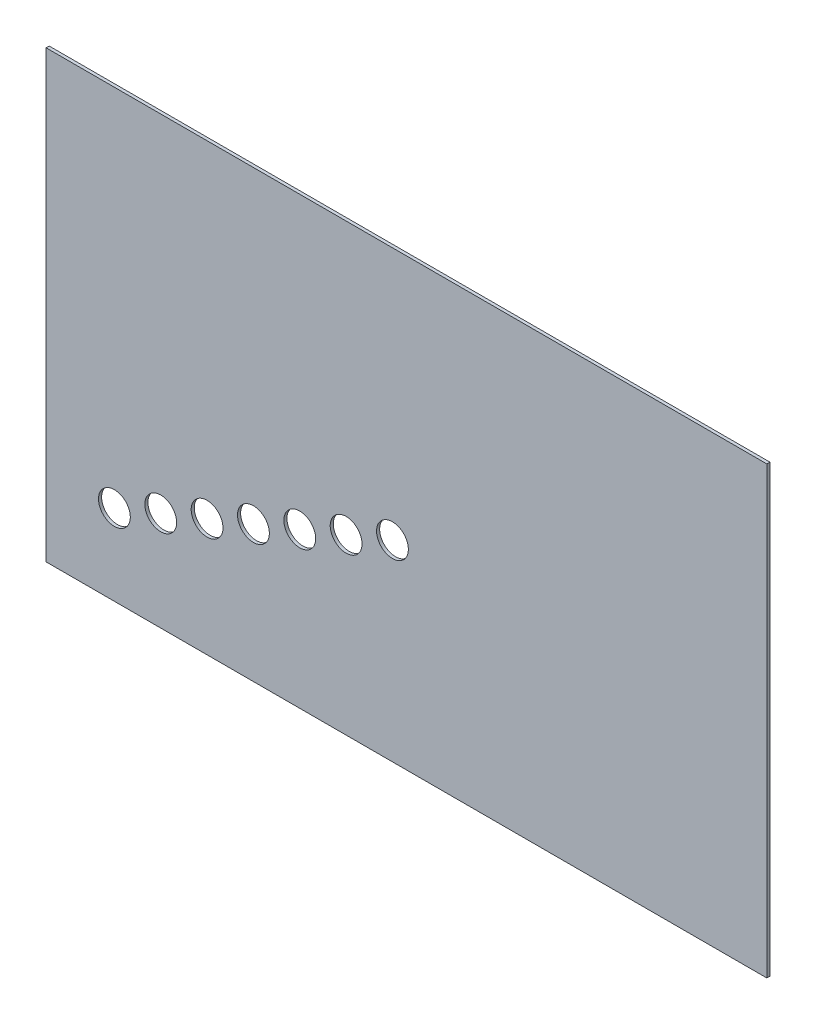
ISO-10303-21;
HEADER;
FILE_DESCRIPTION(('STEP AP214'),'2;1');
FILE_NAME('part.step','',(''),(''),'','','');
FILE_SCHEMA(('AUTOMOTIVE_DESIGN { 1 0 10303 214 1 1 1 1 }'));
ENDSEC;
DATA;
#1=APPLICATION_CONTEXT('core data for automotive mechanical design processes');
#2=APPLICATION_PROTOCOL_DEFINITION('international standard','automotive_design',2000,#1);
#3=PRODUCT_CONTEXT('',#1,'mechanical');
#4=PRODUCT('Part','Part','',(#3));
#5=PRODUCT_RELATED_PRODUCT_CATEGORY('part','',(#4));
#6=PRODUCT_DEFINITION_FORMATION('','',#4);
#7=PRODUCT_DEFINITION_CONTEXT('part definition',#1,'design');
#8=PRODUCT_DEFINITION('design','',#6,#7);
#9=PRODUCT_DEFINITION_SHAPE('','',#8);
#10=(LENGTH_UNIT() NAMED_UNIT(*) SI_UNIT(.MILLI.,.METRE.));
#11=(NAMED_UNIT(*) PLANE_ANGLE_UNIT() SI_UNIT($,.RADIAN.));
#12=(NAMED_UNIT(*) SI_UNIT($,.STERADIAN.) SOLID_ANGLE_UNIT());
#13=UNCERTAINTY_MEASURE_WITH_UNIT(LENGTH_MEASURE(1.E-05),#10,'distance_accuracy_value','');
#14=(GEOMETRIC_REPRESENTATION_CONTEXT(3) GLOBAL_UNCERTAINTY_ASSIGNED_CONTEXT((#13)) GLOBAL_UNIT_ASSIGNED_CONTEXT((#10,
#11,#12)) REPRESENTATION_CONTEXT('',''));
#15=CARTESIAN_POINT('',(0.,0.,0.));
#16=DIRECTION('',(0.,0.,1.));
#17=DIRECTION('',(1.,0.,0.));
#18=AXIS2_PLACEMENT_3D('',#15,#16,#17);
#19=CARTESIAN_POINT('',(116.64547175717,72.0581628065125,1.));
#20=DIRECTION('',(-1.,0.,0.));
#21=DIRECTION('',(0.,0.,1.));
#22=AXIS2_PLACEMENT_3D('',#19,#20,#21);
#23=PLANE('',#22);
#24=DIRECTION('',(0.,1.,0.));
#25=VECTOR('',#24,1.);
#26=CARTESIAN_POINT('',(116.64547175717,72.0581628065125,0.));
#27=LINE('',#26,#25);
#28=CARTESIAN_POINT('',(116.64547175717,-72.0581628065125,0.));
#29=VERTEX_POINT('',#28);
#30=CARTESIAN_POINT('',(116.64547175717,72.0581628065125,0.));
#31=VERTEX_POINT('',#30);
#32=EDGE_CURVE('E104',#29,#31,#27,.T.);
#33=ORIENTED_EDGE('',*,*,#32,.T.);
#34=DIRECTION('',(0.,0.,-1.));
#35=VECTOR('',#34,1.);
#36=CARTESIAN_POINT('',(116.64547175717,72.0581628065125,1.));
#37=LINE('',#36,#35);
#38=CARTESIAN_POINT('',(116.64547175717,72.0581628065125,1.));
#39=VERTEX_POINT('',#38);
#40=EDGE_CURVE('E95',#39,#31,#37,.T.);
#41=ORIENTED_EDGE('',*,*,#40,.F.);
#42=DIRECTION('',(0.,1.,0.));
#43=VECTOR('',#42,1.);
#44=CARTESIAN_POINT('',(116.64547175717,72.0581628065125,1.));
#45=LINE('',#44,#43);
#46=CARTESIAN_POINT('',(116.64547175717,-72.0581628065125,1.));
#47=VERTEX_POINT('',#46);
#48=EDGE_CURVE('E89',#47,#39,#45,.T.);
#49=ORIENTED_EDGE('',*,*,#48,.F.);
#50=DIRECTION('',(0.,0.,-1.));
#51=VECTOR('',#50,1.);
#52=CARTESIAN_POINT('',(116.64547175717,-72.0581628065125,1.));
#53=LINE('',#52,#51);
#54=EDGE_CURVE('E100',#47,#29,#53,.T.);
#55=ORIENTED_EDGE('',*,*,#54,.T.);
#56=EDGE_LOOP('',(#33,#41,#49,#55));
#57=FACE_BOUND('',#56,.T.);
#58=ADVANCED_FACE('F35',(#57),#23,.F.);
#59=CARTESIAN_POINT('',(-116.64547175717,72.0581628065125,1.));
#60=DIRECTION('',(0.,-1.,0.));
#61=DIRECTION('',(0.,0.,-1.));
#62=AXIS2_PLACEMENT_3D('',#59,#60,#61);
#63=PLANE('',#62);
#64=DIRECTION('',(-1.,0.,0.));
#65=VECTOR('',#64,1.);
#66=CARTESIAN_POINT('',(-116.64547175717,72.0581628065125,0.));
#67=LINE('',#66,#65);
#68=CARTESIAN_POINT('',(-116.64547175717,72.0581628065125,0.));
#69=VERTEX_POINT('',#68);
#70=EDGE_CURVE('E94',#31,#69,#67,.T.);
#71=ORIENTED_EDGE('',*,*,#70,.T.);
#72=DIRECTION('',(0.,0.,-1.));
#73=VECTOR('',#72,1.);
#74=CARTESIAN_POINT('',(-116.64547175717,72.0581628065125,1.));
#75=LINE('',#74,#73);
#76=CARTESIAN_POINT('',(-116.64547175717,72.0581628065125,1.));
#77=VERTEX_POINT('',#76);
#78=EDGE_CURVE('E92',#77,#69,#75,.T.);
#79=ORIENTED_EDGE('',*,*,#78,.F.);
#80=DIRECTION('',(-1.,0.,0.));
#81=VECTOR('',#80,1.);
#82=CARTESIAN_POINT('',(-116.64547175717,72.0581628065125,1.));
#83=LINE('',#82,#81);
#84=EDGE_CURVE('E83',#39,#77,#83,.T.);
#85=ORIENTED_EDGE('',*,*,#84,.F.);
#86=ORIENTED_EDGE('',*,*,#40,.T.);
#87=EDGE_LOOP('',(#71,#79,#85,#86));
#88=FACE_BOUND('',#87,.T.);
#89=ADVANCED_FACE('F93',(#88),#63,.F.);
#90=CARTESIAN_POINT('',(-116.64547175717,72.0581628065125,1.));
#91=DIRECTION('',(1.,0.,0.));
#92=DIRECTION('',(0.,0.,-1.));
#93=AXIS2_PLACEMENT_3D('',#90,#91,#92);
#94=PLANE('',#93);
#95=DIRECTION('',(0.,-1.,0.));
#96=VECTOR('',#95,1.);
#97=CARTESIAN_POINT('',(-116.64547175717,72.0581628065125,0.));
#98=LINE('',#97,#96);
#99=CARTESIAN_POINT('',(-116.64547175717,-72.0581628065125,0.));
#100=VERTEX_POINT('',#99);
#101=EDGE_CURVE('E69',#69,#100,#98,.T.);
#102=ORIENTED_EDGE('',*,*,#101,.T.);
#103=DIRECTION('',(0.,0.,-1.));
#104=VECTOR('',#103,1.);
#105=CARTESIAN_POINT('',(-116.64547175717,-72.0581628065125,1.));
#106=LINE('',#105,#104);
#107=CARTESIAN_POINT('',(-116.64547175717,-72.0581628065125,1.));
#108=VERTEX_POINT('',#107);
#109=EDGE_CURVE('E96',#108,#100,#106,.T.);
#110=ORIENTED_EDGE('',*,*,#109,.F.);
#111=DIRECTION('',(0.,-1.,0.));
#112=VECTOR('',#111,1.);
#113=CARTESIAN_POINT('',(-116.64547175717,72.0581628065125,1.));
#114=LINE('',#113,#112);
#115=EDGE_CURVE('E87',#77,#108,#114,.T.);
#116=ORIENTED_EDGE('',*,*,#115,.F.);
#117=ORIENTED_EDGE('',*,*,#78,.T.);
#118=EDGE_LOOP('',(#102,#110,#116,#117));
#119=FACE_BOUND('',#118,.T.);
#120=ADVANCED_FACE('F98',(#119),#94,.F.);
#121=CARTESIAN_POINT('',(-116.64547175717,-72.0581628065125,1.));
#122=DIRECTION('',(0.,1.,0.));
#123=DIRECTION('',(0.,0.,1.));
#124=AXIS2_PLACEMENT_3D('',#121,#122,#123);
#125=PLANE('',#124);
#126=DIRECTION('',(1.,0.,0.));
#127=VECTOR('',#126,1.);
#128=CARTESIAN_POINT('',(-116.64547175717,-72.0581628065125,0.));
#129=LINE('',#128,#127);
#130=EDGE_CURVE('E75',#100,#29,#129,.T.);
#131=ORIENTED_EDGE('',*,*,#130,.T.);
#132=ORIENTED_EDGE('',*,*,#54,.F.);
#133=DIRECTION('',(1.,0.,0.));
#134=VECTOR('',#133,1.);
#135=CARTESIAN_POINT('',(-116.64547175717,-72.0581628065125,1.));
#136=LINE('',#135,#134);
#137=EDGE_CURVE('E52',#108,#47,#136,.T.);
#138=ORIENTED_EDGE('',*,*,#137,.F.);
#139=ORIENTED_EDGE('',*,*,#109,.T.);
#140=EDGE_LOOP('',(#131,#132,#138,#139));
#141=FACE_BOUND('',#140,.T.);
#142=ADVANCED_FACE('F148',(#141),#125,.F.);
#143=CARTESIAN_POINT('',(116.64547175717,-72.0581628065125,1.));
#144=DIRECTION('',(0.,0.,1.));
#145=DIRECTION('',(1.,0.,0.));
#146=AXIS2_PLACEMENT_3D('',#143,#144,#145);
#147=PLANE('',#146);
#148=CARTESIAN_POINT('',(-79.5328669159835,-39.9033671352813,1.));
#149=DIRECTION('',(0.,0.,1.));
#150=DIRECTION('',(1.,0.,0.));
#151=AXIS2_PLACEMENT_3D('',#148,#149,#150);
#152=CIRCLE('',#151,5.14819696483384);
#153=CARTESIAN_POINT('',(-74.3846699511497,-39.9033671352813,1.));
#154=VERTEX_POINT('',#153);
#155=EDGE_CURVE('E276',#154,#154,#152,.T.);
#156=ORIENTED_EDGE('',*,*,#155,.F.);
#157=EDGE_LOOP('',(#156));
#158=FACE_BOUND('',#157,.T.);
#159=CARTESIAN_POINT('',(-94.5328669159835,-45.9033671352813,1.));
#160=DIRECTION('',(0.,0.,1.));
#161=DIRECTION('',(1.,0.,0.));
#162=AXIS2_PLACEMENT_3D('',#159,#160,#161);
#163=CIRCLE('',#162,5.14819696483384);
#164=CARTESIAN_POINT('',(-89.3846699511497,-45.9033671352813,1.));
#165=VERTEX_POINT('',#164);
#166=EDGE_CURVE('E275',#165,#165,#163,.T.);
#167=ORIENTED_EDGE('',*,*,#166,.F.);
#168=EDGE_LOOP('',(#167));
#169=FACE_BOUND('',#168,.T.);
#170=ORIENTED_EDGE('',*,*,#48,.T.);
#171=ORIENTED_EDGE('',*,*,#84,.T.);
#172=ORIENTED_EDGE('',*,*,#115,.T.);
#173=ORIENTED_EDGE('',*,*,#137,.T.);
#174=EDGE_LOOP('',(#170,#171,#172,#173));
#175=FACE_BOUND('',#174,.T.);
#176=CARTESIAN_POINT('',(-64.5328669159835,-33.9033671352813,1.));
#177=DIRECTION('',(0.,0.,1.));
#178=DIRECTION('',(1.,0.,0.));
#179=AXIS2_PLACEMENT_3D('',#176,#177,#178);
#180=CIRCLE('',#179,5.14819696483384);
#181=CARTESIAN_POINT('',(-59.3846699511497,-33.9033671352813,1.));
#182=VERTEX_POINT('',#181);
#183=EDGE_CURVE('E117',#182,#182,#180,.T.);
#184=ORIENTED_EDGE('',*,*,#183,.F.);
#185=EDGE_LOOP('',(#184));
#186=FACE_BOUND('',#185,.T.);
#187=CARTESIAN_POINT('',(-49.5328669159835,-27.9033671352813,1.));
#188=DIRECTION('',(0.,0.,1.));
#189=DIRECTION('',(1.,0.,0.));
#190=AXIS2_PLACEMENT_3D('',#187,#188,#189);
#191=CIRCLE('',#190,5.14819696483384);
#192=CARTESIAN_POINT('',(-44.3846699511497,-27.9033671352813,1.));
#193=VERTEX_POINT('',#192);
#194=EDGE_CURVE('E123',#193,#193,#191,.T.);
#195=ORIENTED_EDGE('',*,*,#194,.F.);
#196=EDGE_LOOP('',(#195));
#197=FACE_BOUND('',#196,.T.);
#198=CARTESIAN_POINT('',(-34.5328669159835,-21.9033671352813,1.));
#199=DIRECTION('',(0.,0.,1.));
#200=DIRECTION('',(1.,0.,0.));
#201=AXIS2_PLACEMENT_3D('',#198,#199,#200);
#202=CIRCLE('',#201,5.14819696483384);
#203=CARTESIAN_POINT('',(-29.3846699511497,-21.9033671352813,1.));
#204=VERTEX_POINT('',#203);
#205=EDGE_CURVE('E129',#204,#204,#202,.T.);
#206=ORIENTED_EDGE('',*,*,#205,.F.);
#207=EDGE_LOOP('',(#206));
#208=FACE_BOUND('',#207,.T.);
#209=CARTESIAN_POINT('',(-19.5328669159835,-15.9033671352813,1.));
#210=DIRECTION('',(0.,0.,1.));
#211=DIRECTION('',(1.,0.,0.));
#212=AXIS2_PLACEMENT_3D('',#209,#210,#211);
#213=CIRCLE('',#212,5.14819696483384);
#214=CARTESIAN_POINT('',(-14.3846699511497,-15.9033671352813,1.));
#215=VERTEX_POINT('',#214);
#216=EDGE_CURVE('E135',#215,#215,#213,.T.);
#217=ORIENTED_EDGE('',*,*,#216,.F.);
#218=EDGE_LOOP('',(#217));
#219=FACE_BOUND('',#218,.T.);
#220=CARTESIAN_POINT('',(-4.53286691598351,-9.90336713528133,1.));
#221=DIRECTION('',(0.,0.,1.));
#222=DIRECTION('',(1.,0.,0.));
#223=AXIS2_PLACEMENT_3D('',#220,#221,#222);
#224=CIRCLE('',#223,5.14819696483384);
#225=CARTESIAN_POINT('',(0.615330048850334,-9.90336713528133,1.));
#226=VERTEX_POINT('',#225);
#227=EDGE_CURVE('E11',#226,#226,#224,.T.);
#228=ORIENTED_EDGE('',*,*,#227,.F.);
#229=EDGE_LOOP('',(#228));
#230=FACE_BOUND('',#229,.T.);
#231=ADVANCED_FACE('F84',(#158,#169,#175,#186,#197,#208,#219,#230),#147,.T.);
#232=CARTESIAN_POINT('',(116.64547175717,-72.0581628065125,0.));
#233=DIRECTION('',(0.,0.,1.));
#234=DIRECTION('',(1.,0.,0.));
#235=AXIS2_PLACEMENT_3D('',#232,#233,#234);
#236=PLANE('',#235);
#237=CARTESIAN_POINT('',(-79.5328669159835,-39.9033671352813,0.));
#238=DIRECTION('',(0.,0.,1.));
#239=DIRECTION('',(1.,0.,0.));
#240=AXIS2_PLACEMENT_3D('',#237,#238,#239);
#241=CIRCLE('',#240,5.14819696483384);
#242=CARTESIAN_POINT('',(-74.3846699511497,-39.9033671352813,0.));
#243=VERTEX_POINT('',#242);
#244=EDGE_CURVE('E280',#243,#243,#241,.T.);
#245=ORIENTED_EDGE('',*,*,#244,.T.);
#246=EDGE_LOOP('',(#245));
#247=FACE_BOUND('',#246,.T.);
#248=CARTESIAN_POINT('',(-94.5328669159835,-45.9033671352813,0.));
#249=DIRECTION('',(0.,0.,1.));
#250=DIRECTION('',(1.,0.,0.));
#251=AXIS2_PLACEMENT_3D('',#248,#249,#250);
#252=CIRCLE('',#251,5.14819696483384);
#253=CARTESIAN_POINT('',(-89.3846699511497,-45.9033671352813,0.));
#254=VERTEX_POINT('',#253);
#255=EDGE_CURVE('E107',#254,#254,#252,.T.);
#256=ORIENTED_EDGE('',*,*,#255,.T.);
#257=EDGE_LOOP('',(#256));
#258=FACE_BOUND('',#257,.T.);
#259=ORIENTED_EDGE('',*,*,#32,.F.);
#260=ORIENTED_EDGE('',*,*,#130,.F.);
#261=ORIENTED_EDGE('',*,*,#101,.F.);
#262=ORIENTED_EDGE('',*,*,#70,.F.);
#263=EDGE_LOOP('',(#259,#260,#261,#262));
#264=FACE_BOUND('',#263,.T.);
#265=CARTESIAN_POINT('',(-64.5328669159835,-33.9033671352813,0.));
#266=DIRECTION('',(0.,0.,1.));
#267=DIRECTION('',(1.,0.,0.));
#268=AXIS2_PLACEMENT_3D('',#265,#266,#267);
#269=CIRCLE('',#268,5.14819696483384);
#270=CARTESIAN_POINT('',(-59.3846699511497,-33.9033671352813,0.));
#271=VERTEX_POINT('',#270);
#272=EDGE_CURVE('E114',#271,#271,#269,.T.);
#273=ORIENTED_EDGE('',*,*,#272,.T.);
#274=EDGE_LOOP('',(#273));
#275=FACE_BOUND('',#274,.T.);
#276=CARTESIAN_POINT('',(-49.5328669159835,-27.9033671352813,0.));
#277=DIRECTION('',(0.,0.,1.));
#278=DIRECTION('',(1.,0.,0.));
#279=AXIS2_PLACEMENT_3D('',#276,#277,#278);
#280=CIRCLE('',#279,5.14819696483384);
#281=CARTESIAN_POINT('',(-44.3846699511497,-27.9033671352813,0.));
#282=VERTEX_POINT('',#281);
#283=EDGE_CURVE('E120',#282,#282,#280,.T.);
#284=ORIENTED_EDGE('',*,*,#283,.T.);
#285=EDGE_LOOP('',(#284));
#286=FACE_BOUND('',#285,.T.);
#287=CARTESIAN_POINT('',(-34.5328669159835,-21.9033671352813,0.));
#288=DIRECTION('',(0.,0.,1.));
#289=DIRECTION('',(1.,0.,0.));
#290=AXIS2_PLACEMENT_3D('',#287,#288,#289);
#291=CIRCLE('',#290,5.14819696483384);
#292=CARTESIAN_POINT('',(-29.3846699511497,-21.9033671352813,0.));
#293=VERTEX_POINT('',#292);
#294=EDGE_CURVE('E126',#293,#293,#291,.T.);
#295=ORIENTED_EDGE('',*,*,#294,.T.);
#296=EDGE_LOOP('',(#295));
#297=FACE_BOUND('',#296,.T.);
#298=CARTESIAN_POINT('',(-19.5328669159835,-15.9033671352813,0.));
#299=DIRECTION('',(0.,0.,1.));
#300=DIRECTION('',(1.,0.,0.));
#301=AXIS2_PLACEMENT_3D('',#298,#299,#300);
#302=CIRCLE('',#301,5.14819696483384);
#303=CARTESIAN_POINT('',(-14.3846699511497,-15.9033671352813,0.));
#304=VERTEX_POINT('',#303);
#305=EDGE_CURVE('E132',#304,#304,#302,.T.);
#306=ORIENTED_EDGE('',*,*,#305,.T.);
#307=EDGE_LOOP('',(#306));
#308=FACE_BOUND('',#307,.T.);
#309=CARTESIAN_POINT('',(-4.53286691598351,-9.90336713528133,0.));
#310=DIRECTION('',(0.,0.,1.));
#311=DIRECTION('',(1.,0.,0.));
#312=AXIS2_PLACEMENT_3D('',#309,#310,#311);
#313=CIRCLE('',#312,5.14819696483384);
#314=CARTESIAN_POINT('',(0.615330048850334,-9.90336713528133,0.));
#315=VERTEX_POINT('',#314);
#316=EDGE_CURVE('E44',#315,#315,#313,.T.);
#317=ORIENTED_EDGE('',*,*,#316,.T.);
#318=EDGE_LOOP('',(#317));
#319=FACE_BOUND('',#318,.T.);
#320=ADVANCED_FACE('F140',(#247,#258,#264,#275,#286,#297,#308,#319),#236,.F.);
#321=CARTESIAN_POINT('',(-94.5328669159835,-45.9033671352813,0.));
#322=DIRECTION('',(0.,0.,1.));
#323=DIRECTION('',(1.,0.,0.));
#324=AXIS2_PLACEMENT_3D('',#321,#322,#323);
#325=CYLINDRICAL_SURFACE('',#324,5.14819696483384);
#326=ORIENTED_EDGE('',*,*,#255,.F.);
#327=EDGE_LOOP('',(#326));
#328=FACE_BOUND('',#327,.T.);
#329=ORIENTED_EDGE('',*,*,#166,.T.);
#330=EDGE_LOOP('',(#329));
#331=FACE_BOUND('',#330,.T.);
#332=ADVANCED_FACE('F155',(#328,#331),#325,.F.);
#333=CARTESIAN_POINT('',(-79.5328669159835,-39.9033671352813,0.));
#334=DIRECTION('',(0.,0.,1.));
#335=DIRECTION('',(1.,0.,0.));
#336=AXIS2_PLACEMENT_3D('',#333,#334,#335);
#337=CYLINDRICAL_SURFACE('',#336,5.14819696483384);
#338=ORIENTED_EDGE('',*,*,#244,.F.);
#339=EDGE_LOOP('',(#338));
#340=FACE_BOUND('',#339,.T.);
#341=ORIENTED_EDGE('',*,*,#155,.T.);
#342=EDGE_LOOP('',(#341));
#343=FACE_BOUND('',#342,.T.);
#344=ADVANCED_FACE('F175',(#340,#343),#337,.F.);
#345=CARTESIAN_POINT('',(-64.5328669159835,-33.9033671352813,0.));
#346=DIRECTION('',(0.,0.,1.));
#347=DIRECTION('',(1.,0.,0.));
#348=AXIS2_PLACEMENT_3D('',#345,#346,#347);
#349=CYLINDRICAL_SURFACE('',#348,5.14819696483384);
#350=ORIENTED_EDGE('',*,*,#272,.F.);
#351=EDGE_LOOP('',(#350));
#352=FACE_BOUND('',#351,.T.);
#353=ORIENTED_EDGE('',*,*,#183,.T.);
#354=EDGE_LOOP('',(#353));
#355=FACE_BOUND('',#354,.T.);
#356=ADVANCED_FACE('F171',(#352,#355),#349,.F.);
#357=CARTESIAN_POINT('',(-49.5328669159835,-27.9033671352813,0.));
#358=DIRECTION('',(0.,0.,1.));
#359=DIRECTION('',(1.,0.,0.));
#360=AXIS2_PLACEMENT_3D('',#357,#358,#359);
#361=CYLINDRICAL_SURFACE('',#360,5.14819696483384);
#362=ORIENTED_EDGE('',*,*,#283,.F.);
#363=EDGE_LOOP('',(#362));
#364=FACE_BOUND('',#363,.T.);
#365=ORIENTED_EDGE('',*,*,#194,.T.);
#366=EDGE_LOOP('',(#365));
#367=FACE_BOUND('',#366,.T.);
#368=ADVANCED_FACE('F174',(#364,#367),#361,.F.);
#369=CARTESIAN_POINT('',(-34.5328669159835,-21.9033671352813,0.));
#370=DIRECTION('',(0.,0.,1.));
#371=DIRECTION('',(1.,0.,0.));
#372=AXIS2_PLACEMENT_3D('',#369,#370,#371);
#373=CYLINDRICAL_SURFACE('',#372,5.14819696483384);
#374=ORIENTED_EDGE('',*,*,#294,.F.);
#375=EDGE_LOOP('',(#374));
#376=FACE_BOUND('',#375,.T.);
#377=ORIENTED_EDGE('',*,*,#205,.T.);
#378=EDGE_LOOP('',(#377));
#379=FACE_BOUND('',#378,.T.);
#380=ADVANCED_FACE('F179',(#376,#379),#373,.F.);
#381=CARTESIAN_POINT('',(-19.5328669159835,-15.9033671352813,0.));
#382=DIRECTION('',(0.,0.,1.));
#383=DIRECTION('',(1.,0.,0.));
#384=AXIS2_PLACEMENT_3D('',#381,#382,#383);
#385=CYLINDRICAL_SURFACE('',#384,5.14819696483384);
#386=ORIENTED_EDGE('',*,*,#305,.F.);
#387=EDGE_LOOP('',(#386));
#388=FACE_BOUND('',#387,.T.);
#389=ORIENTED_EDGE('',*,*,#216,.T.);
#390=EDGE_LOOP('',(#389));
#391=FACE_BOUND('',#390,.T.);
#392=ADVANCED_FACE('F144',(#388,#391),#385,.F.);
#393=CARTESIAN_POINT('',(-4.53286691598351,-9.90336713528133,0.));
#394=DIRECTION('',(0.,0.,1.));
#395=DIRECTION('',(1.,0.,0.));
#396=AXIS2_PLACEMENT_3D('',#393,#394,#395);
#397=CYLINDRICAL_SURFACE('',#396,5.14819696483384);
#398=ORIENTED_EDGE('',*,*,#316,.F.);
#399=EDGE_LOOP('',(#398));
#400=FACE_BOUND('',#399,.T.);
#401=ORIENTED_EDGE('',*,*,#227,.T.);
#402=EDGE_LOOP('',(#401));
#403=FACE_BOUND('',#402,.T.);
#404=ADVANCED_FACE('F37',(#400,#403),#397,.F.);
#405=CLOSED_SHELL('',(#58,#89,#120,#142,#231,#320,#332,#344,#356,#368,#380,#392,#404));
#406=MANIFOLD_SOLID_BREP('B2',#405);
#407=ADVANCED_BREP_SHAPE_REPRESENTATION('',(#18,#406),#14);
#408=SHAPE_DEFINITION_REPRESENTATION(#9,#407);
ENDSEC;
END-ISO-10303-21;
